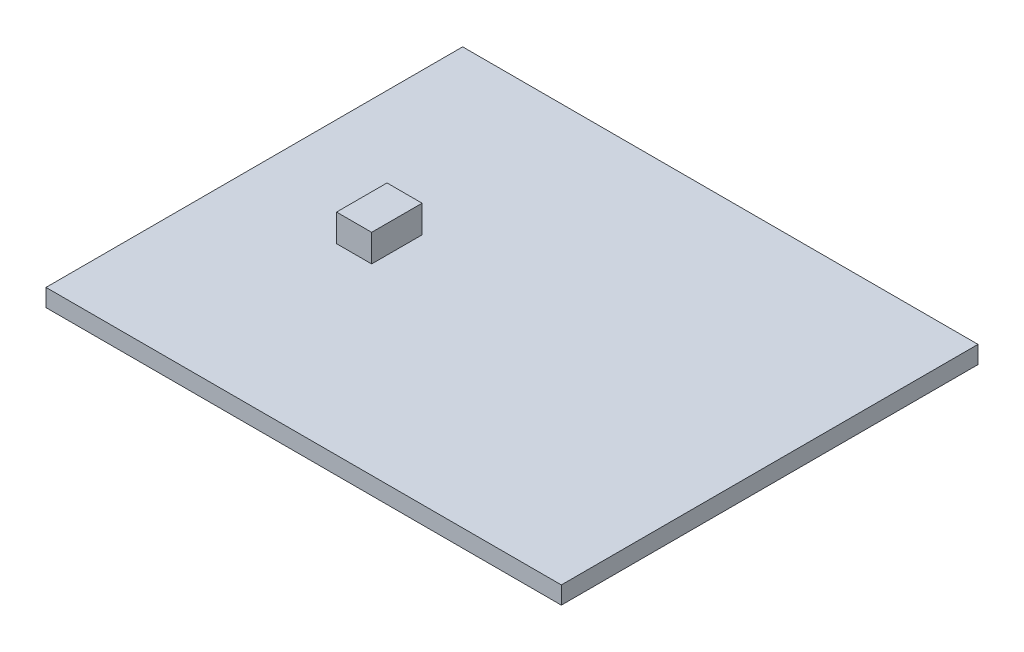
ISO-10303-21;
HEADER;
FILE_DESCRIPTION(('STEP AP214'),'2;1');
FILE_NAME('part.step','',(''),(''),'','','');
FILE_SCHEMA(('AUTOMOTIVE_DESIGN { 1 0 10303 214 1 1 1 1 }'));
ENDSEC;
DATA;
#1=APPLICATION_CONTEXT('core data for automotive mechanical design processes');
#2=APPLICATION_PROTOCOL_DEFINITION('international standard','automotive_design',2000,#1);
#3=PRODUCT_CONTEXT('',#1,'mechanical');
#4=PRODUCT('Part','Part','',(#3));
#5=PRODUCT_RELATED_PRODUCT_CATEGORY('part','',(#4));
#6=PRODUCT_DEFINITION_FORMATION('','',#4);
#7=PRODUCT_DEFINITION_CONTEXT('part definition',#1,'design');
#8=PRODUCT_DEFINITION('design','',#6,#7);
#9=PRODUCT_DEFINITION_SHAPE('','',#8);
#10=(LENGTH_UNIT() NAMED_UNIT(*) SI_UNIT(.MILLI.,.METRE.));
#11=(NAMED_UNIT(*) PLANE_ANGLE_UNIT() SI_UNIT($,.RADIAN.));
#12=(NAMED_UNIT(*) SI_UNIT($,.STERADIAN.) SOLID_ANGLE_UNIT());
#13=UNCERTAINTY_MEASURE_WITH_UNIT(LENGTH_MEASURE(1.E-05),#10,'distance_accuracy_value','');
#14=(GEOMETRIC_REPRESENTATION_CONTEXT(3) GLOBAL_UNCERTAINTY_ASSIGNED_CONTEXT((#13)) GLOBAL_UNIT_ASSIGNED_CONTEXT((#10,
#11,#12)) REPRESENTATION_CONTEXT('',''));
#15=CARTESIAN_POINT('',(0.,0.,0.));
#16=DIRECTION('',(0.,0.,1.));
#17=DIRECTION('',(1.,0.,0.));
#18=AXIS2_PLACEMENT_3D('',#15,#16,#17);
#19=CARTESIAN_POINT('',(0.,0.,0.));
#20=DIRECTION('',(0.,-1.,0.));
#21=DIRECTION('',(0.,0.,-1.));
#22=AXIS2_PLACEMENT_3D('',#19,#20,#21);
#23=PLANE('',#22);
#24=DIRECTION('',(0.,0.,1.));
#25=VECTOR('',#24,1.);
#26=CARTESIAN_POINT('',(0.,0.,0.));
#27=LINE('',#26,#25);
#28=CARTESIAN_POINT('',(0.,0.,-38.));
#29=VERTEX_POINT('',#28);
#30=CARTESIAN_POINT('',(0.,0.,0.));
#31=VERTEX_POINT('',#30);
#32=EDGE_CURVE('E183',#29,#31,#27,.T.);
#33=ORIENTED_EDGE('',*,*,#32,.F.);
#34=DIRECTION('',(-1.,0.,0.));
#35=VECTOR('',#34,1.);
#36=CARTESIAN_POINT('',(0.,0.,-38.));
#37=LINE('',#36,#35);
#38=CARTESIAN_POINT('',(47.,0.,-38.));
#39=VERTEX_POINT('',#38);
#40=EDGE_CURVE('E188',#39,#29,#37,.T.);
#41=ORIENTED_EDGE('',*,*,#40,.F.);
#42=DIRECTION('',(0.,0.,-1.));
#43=VECTOR('',#42,1.);
#44=CARTESIAN_POINT('',(47.,0.,0.));
#45=LINE('',#44,#43);
#46=CARTESIAN_POINT('',(47.,0.,0.));
#47=VERTEX_POINT('',#46);
#48=EDGE_CURVE('E199',#47,#39,#45,.T.);
#49=ORIENTED_EDGE('',*,*,#48,.F.);
#50=DIRECTION('',(1.,0.,0.));
#51=VECTOR('',#50,1.);
#52=CARTESIAN_POINT('',(0.,0.,0.));
#53=LINE('',#52,#51);
#54=EDGE_CURVE('E197',#31,#47,#53,.T.);
#55=ORIENTED_EDGE('',*,*,#54,.F.);
#56=EDGE_LOOP('',(#33,#41,#49,#55));
#57=FACE_BOUND('',#56,.T.);
#58=DIRECTION('',(1.,0.,0.));
#59=VECTOR('',#58,1.);
#60=CARTESIAN_POINT('',(13.0000000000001,0.,-21.3));
#61=LINE('',#60,#59);
#62=CARTESIAN_POINT('',(9.80000000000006,0.,-21.3));
#63=VERTEX_POINT('',#62);
#64=CARTESIAN_POINT('',(13.0000000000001,0.,-21.3));
#65=VERTEX_POINT('',#64);
#66=EDGE_CURVE('E373',#63,#65,#61,.T.);
#67=ORIENTED_EDGE('',*,*,#66,.F.);
#68=DIRECTION('',(0.,0.,-1.));
#69=VECTOR('',#68,1.);
#70=CARTESIAN_POINT('',(9.80000000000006,0.,-21.3));
#71=LINE('',#70,#69);
#72=CARTESIAN_POINT('',(9.80000000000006,0.,-16.7));
#73=VERTEX_POINT('',#72);
#74=EDGE_CURVE('E147',#73,#63,#71,.T.);
#75=ORIENTED_EDGE('',*,*,#74,.F.);
#76=DIRECTION('',(-1.,0.,0.));
#77=VECTOR('',#76,1.);
#78=CARTESIAN_POINT('',(9.80000000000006,0.,-16.7));
#79=LINE('',#78,#77);
#80=CARTESIAN_POINT('',(13.0000000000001,0.,-16.7));
#81=VERTEX_POINT('',#80);
#82=EDGE_CURVE('E143',#81,#73,#79,.T.);
#83=ORIENTED_EDGE('',*,*,#82,.F.);
#84=DIRECTION('',(0.,0.,1.));
#85=VECTOR('',#84,1.);
#86=CARTESIAN_POINT('',(13.0000000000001,0.,-16.7));
#87=LINE('',#86,#85);
#88=EDGE_CURVE('E370',#65,#81,#87,.T.);
#89=ORIENTED_EDGE('',*,*,#88,.F.);
#90=EDGE_LOOP('',(#67,#75,#83,#89));
#91=FACE_BOUND('',#90,.T.);
#92=ADVANCED_FACE('F35',(#57,#91),#23,.T.);
#93=CARTESIAN_POINT('',(0.,1.6,0.));
#94=DIRECTION('',(0.,-1.,0.));
#95=DIRECTION('',(0.,0.,-1.));
#96=AXIS2_PLACEMENT_3D('',#93,#94,#95);
#97=PLANE('',#96);
#98=DIRECTION('',(0.,0.,1.));
#99=VECTOR('',#98,1.);
#100=CARTESIAN_POINT('',(0.,1.6,0.));
#101=LINE('',#100,#99);
#102=CARTESIAN_POINT('',(0.,1.6,-38.));
#103=VERTEX_POINT('',#102);
#104=CARTESIAN_POINT('',(0.,1.6,0.));
#105=VERTEX_POINT('',#104);
#106=EDGE_CURVE('E184',#103,#105,#101,.T.);
#107=ORIENTED_EDGE('',*,*,#106,.T.);
#108=DIRECTION('',(1.,0.,0.));
#109=VECTOR('',#108,1.);
#110=CARTESIAN_POINT('',(0.,1.6,0.));
#111=LINE('',#110,#109);
#112=CARTESIAN_POINT('',(47.,1.6,0.));
#113=VERTEX_POINT('',#112);
#114=EDGE_CURVE('E187',#105,#113,#111,.T.);
#115=ORIENTED_EDGE('',*,*,#114,.T.);
#116=DIRECTION('',(0.,0.,-1.));
#117=VECTOR('',#116,1.);
#118=CARTESIAN_POINT('',(47.,1.6,0.));
#119=LINE('',#118,#117);
#120=CARTESIAN_POINT('',(47.,1.6,-38.));
#121=VERTEX_POINT('',#120);
#122=EDGE_CURVE('E190',#113,#121,#119,.T.);
#123=ORIENTED_EDGE('',*,*,#122,.T.);
#124=DIRECTION('',(-1.,0.,0.));
#125=VECTOR('',#124,1.);
#126=CARTESIAN_POINT('',(0.,1.6,-38.));
#127=LINE('',#126,#125);
#128=EDGE_CURVE('E192',#121,#103,#127,.T.);
#129=ORIENTED_EDGE('',*,*,#128,.T.);
#130=EDGE_LOOP('',(#107,#115,#123,#129));
#131=FACE_BOUND('',#130,.T.);
#132=DIRECTION('',(0.,0.,1.));
#133=VECTOR('',#132,1.);
#134=CARTESIAN_POINT('',(9.80000000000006,1.6,-21.3));
#135=LINE('',#134,#133);
#136=CARTESIAN_POINT('',(9.80000000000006,1.6,-21.3));
#137=VERTEX_POINT('',#136);
#138=CARTESIAN_POINT('',(9.80000000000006,1.6,-16.7));
#139=VERTEX_POINT('',#138);
#140=EDGE_CURVE('E149',#137,#139,#135,.T.);
#141=ORIENTED_EDGE('',*,*,#140,.F.);
#142=DIRECTION('',(-1.,0.,0.));
#143=VECTOR('',#142,1.);
#144=CARTESIAN_POINT('',(9.80000000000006,1.6,-21.3));
#145=LINE('',#144,#143);
#146=CARTESIAN_POINT('',(13.0000000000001,1.6,-21.3));
#147=VERTEX_POINT('',#146);
#148=EDGE_CURVE('E160',#147,#137,#145,.T.);
#149=ORIENTED_EDGE('',*,*,#148,.F.);
#150=DIRECTION('',(0.,0.,-1.));
#151=VECTOR('',#150,1.);
#152=CARTESIAN_POINT('',(13.0000000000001,1.6,-21.3));
#153=LINE('',#152,#151);
#154=CARTESIAN_POINT('',(13.0000000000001,1.6,-16.7));
#155=VERTEX_POINT('',#154);
#156=EDGE_CURVE('E168',#155,#147,#153,.T.);
#157=ORIENTED_EDGE('',*,*,#156,.F.);
#158=DIRECTION('',(1.,0.,0.));
#159=VECTOR('',#158,1.);
#160=CARTESIAN_POINT('',(9.80000000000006,1.6,-16.7));
#161=LINE('',#160,#159);
#162=EDGE_CURVE('E58',#139,#155,#161,.T.);
#163=ORIENTED_EDGE('',*,*,#162,.F.);
#164=EDGE_LOOP('',(#141,#149,#157,#163));
#165=FACE_BOUND('',#164,.T.);
#166=ADVANCED_FACE('F226',(#131,#165),#97,.F.);
#167=CARTESIAN_POINT('',(0.,1.6,0.));
#168=DIRECTION('',(1.,0.,0.));
#169=DIRECTION('',(0.,0.,-1.));
#170=AXIS2_PLACEMENT_3D('',#167,#168,#169);
#171=PLANE('',#170);
#172=ORIENTED_EDGE('',*,*,#32,.T.);
#173=DIRECTION('',(0.,-1.,0.));
#174=VECTOR('',#173,1.);
#175=CARTESIAN_POINT('',(0.,1.6,0.));
#176=LINE('',#175,#174);
#177=EDGE_CURVE('E11',#105,#31,#176,.T.);
#178=ORIENTED_EDGE('',*,*,#177,.F.);
#179=ORIENTED_EDGE('',*,*,#106,.F.);
#180=DIRECTION('',(0.,-1.,0.));
#181=VECTOR('',#180,1.);
#182=CARTESIAN_POINT('',(0.,1.6,-38.));
#183=LINE('',#182,#181);
#184=EDGE_CURVE('E194',#103,#29,#183,.T.);
#185=ORIENTED_EDGE('',*,*,#184,.T.);
#186=EDGE_LOOP('',(#172,#178,#179,#185));
#187=FACE_BOUND('',#186,.T.);
#188=ADVANCED_FACE('F37',(#187),#171,.F.);
#189=CARTESIAN_POINT('',(0.,1.6,0.));
#190=DIRECTION('',(0.,0.,-1.));
#191=DIRECTION('',(-1.,0.,0.));
#192=AXIS2_PLACEMENT_3D('',#189,#190,#191);
#193=PLANE('',#192);
#194=ORIENTED_EDGE('',*,*,#54,.T.);
#195=DIRECTION('',(0.,-1.,0.));
#196=VECTOR('',#195,1.);
#197=CARTESIAN_POINT('',(47.,1.6,0.));
#198=LINE('',#197,#196);
#199=EDGE_CURVE('E43',#113,#47,#198,.T.);
#200=ORIENTED_EDGE('',*,*,#199,.F.);
#201=ORIENTED_EDGE('',*,*,#114,.F.);
#202=ORIENTED_EDGE('',*,*,#177,.T.);
#203=EDGE_LOOP('',(#194,#200,#201,#202));
#204=FACE_BOUND('',#203,.T.);
#205=ADVANCED_FACE('F227',(#204),#193,.F.);
#206=CARTESIAN_POINT('',(47.,1.6,0.));
#207=DIRECTION('',(-1.,0.,0.));
#208=DIRECTION('',(0.,0.,1.));
#209=AXIS2_PLACEMENT_3D('',#206,#207,#208);
#210=PLANE('',#209);
#211=ORIENTED_EDGE('',*,*,#48,.T.);
#212=DIRECTION('',(0.,-1.,0.));
#213=VECTOR('',#212,1.);
#214=CARTESIAN_POINT('',(47.,1.6,-38.));
#215=LINE('',#214,#213);
#216=EDGE_CURVE('E204',#121,#39,#215,.T.);
#217=ORIENTED_EDGE('',*,*,#216,.F.);
#218=ORIENTED_EDGE('',*,*,#122,.F.);
#219=ORIENTED_EDGE('',*,*,#199,.T.);
#220=EDGE_LOOP('',(#211,#217,#218,#219));
#221=FACE_BOUND('',#220,.T.);
#222=ADVANCED_FACE('F211',(#221),#210,.F.);
#223=CARTESIAN_POINT('',(0.,1.6,-38.));
#224=DIRECTION('',(0.,0.,1.));
#225=DIRECTION('',(1.,0.,0.));
#226=AXIS2_PLACEMENT_3D('',#223,#224,#225);
#227=PLANE('',#226);
#228=ORIENTED_EDGE('',*,*,#40,.T.);
#229=ORIENTED_EDGE('',*,*,#184,.F.);
#230=ORIENTED_EDGE('',*,*,#128,.F.);
#231=ORIENTED_EDGE('',*,*,#216,.T.);
#232=EDGE_LOOP('',(#228,#229,#230,#231));
#233=FACE_BOUND('',#232,.T.);
#234=ADVANCED_FACE('F220',(#233),#227,.F.);
#235=CARTESIAN_POINT('',(9.80000000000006,4.1,-21.3));
#236=DIRECTION('',(1.,0.,0.));
#237=DIRECTION('',(0.,0.,-1.));
#238=AXIS2_PLACEMENT_3D('',#235,#236,#237);
#239=PLANE('',#238);
#240=ORIENTED_EDGE('',*,*,#140,.T.);
#241=DIRECTION('',(0.,-1.,0.));
#242=VECTOR('',#241,1.);
#243=CARTESIAN_POINT('',(9.80000000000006,4.1,-16.7));
#244=LINE('',#243,#242);
#245=CARTESIAN_POINT('',(9.80000000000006,4.1,-16.7));
#246=VERTEX_POINT('',#245);
#247=EDGE_CURVE('E181',#246,#139,#244,.T.);
#248=ORIENTED_EDGE('',*,*,#247,.F.);
#249=DIRECTION('',(0.,0.,1.));
#250=VECTOR('',#249,1.);
#251=CARTESIAN_POINT('',(9.80000000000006,4.1,-21.3));
#252=LINE('',#251,#250);
#253=CARTESIAN_POINT('',(9.80000000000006,4.1,-21.3));
#254=VERTEX_POINT('',#253);
#255=EDGE_CURVE('E156',#254,#246,#252,.T.);
#256=ORIENTED_EDGE('',*,*,#255,.F.);
#257=DIRECTION('',(0.,-1.,0.));
#258=VECTOR('',#257,1.);
#259=CARTESIAN_POINT('',(9.80000000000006,4.1,-21.3));
#260=LINE('',#259,#258);
#261=EDGE_CURVE('E165',#254,#137,#260,.T.);
#262=ORIENTED_EDGE('',*,*,#261,.T.);
#263=EDGE_LOOP('',(#240,#248,#256,#262));
#264=FACE_BOUND('',#263,.T.);
#265=ADVANCED_FACE('F245',(#264),#239,.F.);
#266=CARTESIAN_POINT('',(9.80000000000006,4.1,-16.7));
#267=DIRECTION('',(0.,0.,-1.));
#268=DIRECTION('',(-1.,0.,0.));
#269=AXIS2_PLACEMENT_3D('',#266,#267,#268);
#270=PLANE('',#269);
#271=ORIENTED_EDGE('',*,*,#162,.T.);
#272=DIRECTION('',(0.,-1.,0.));
#273=VECTOR('',#272,1.);
#274=CARTESIAN_POINT('',(13.0000000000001,4.1,-16.7));
#275=LINE('',#274,#273);
#276=CARTESIAN_POINT('',(13.0000000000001,4.1,-16.7));
#277=VERTEX_POINT('',#276);
#278=EDGE_CURVE('E178',#277,#155,#275,.T.);
#279=ORIENTED_EDGE('',*,*,#278,.F.);
#280=DIRECTION('',(1.,0.,0.));
#281=VECTOR('',#280,1.);
#282=CARTESIAN_POINT('',(9.80000000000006,4.1,-16.7));
#283=LINE('',#282,#281);
#284=EDGE_CURVE('E159',#246,#277,#283,.T.);
#285=ORIENTED_EDGE('',*,*,#284,.F.);
#286=ORIENTED_EDGE('',*,*,#247,.T.);
#287=EDGE_LOOP('',(#271,#279,#285,#286));
#288=FACE_BOUND('',#287,.T.);
#289=ADVANCED_FACE('F250',(#288),#270,.F.);
#290=CARTESIAN_POINT('',(13.0000000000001,4.1,-21.3));
#291=DIRECTION('',(-1.,0.,0.));
#292=DIRECTION('',(0.,0.,1.));
#293=AXIS2_PLACEMENT_3D('',#290,#291,#292);
#294=PLANE('',#293);
#295=ORIENTED_EDGE('',*,*,#156,.T.);
#296=DIRECTION('',(0.,-1.,0.));
#297=VECTOR('',#296,1.);
#298=CARTESIAN_POINT('',(13.0000000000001,4.1,-21.3));
#299=LINE('',#298,#297);
#300=CARTESIAN_POINT('',(13.0000000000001,4.1,-21.3));
#301=VERTEX_POINT('',#300);
#302=EDGE_CURVE('E175',#301,#147,#299,.T.);
#303=ORIENTED_EDGE('',*,*,#302,.F.);
#304=DIRECTION('',(0.,0.,-1.));
#305=VECTOR('',#304,1.);
#306=CARTESIAN_POINT('',(13.0000000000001,4.1,-21.3));
#307=LINE('',#306,#305);
#308=EDGE_CURVE('E162',#277,#301,#307,.T.);
#309=ORIENTED_EDGE('',*,*,#308,.F.);
#310=ORIENTED_EDGE('',*,*,#278,.T.);
#311=EDGE_LOOP('',(#295,#303,#309,#310));
#312=FACE_BOUND('',#311,.T.);
#313=ADVANCED_FACE('F256',(#312),#294,.F.);
#314=CARTESIAN_POINT('',(9.80000000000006,4.1,-21.3));
#315=DIRECTION('',(0.,0.,1.));
#316=DIRECTION('',(1.,0.,0.));
#317=AXIS2_PLACEMENT_3D('',#314,#315,#316);
#318=PLANE('',#317);
#319=ORIENTED_EDGE('',*,*,#148,.T.);
#320=ORIENTED_EDGE('',*,*,#261,.F.);
#321=DIRECTION('',(-1.,0.,0.));
#322=VECTOR('',#321,1.);
#323=CARTESIAN_POINT('',(9.80000000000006,4.1,-21.3));
#324=LINE('',#323,#322);
#325=EDGE_CURVE('E164',#301,#254,#324,.T.);
#326=ORIENTED_EDGE('',*,*,#325,.F.);
#327=ORIENTED_EDGE('',*,*,#302,.T.);
#328=EDGE_LOOP('',(#319,#320,#326,#327));
#329=FACE_BOUND('',#328,.T.);
#330=ADVANCED_FACE('F262',(#329),#318,.F.);
#331=CARTESIAN_POINT('',(0.,4.1,0.));
#332=DIRECTION('',(0.,1.,0.));
#333=DIRECTION('',(0.,0.,1.));
#334=AXIS2_PLACEMENT_3D('',#331,#332,#333);
#335=PLANE('',#334);
#336=ORIENTED_EDGE('',*,*,#255,.T.);
#337=ORIENTED_EDGE('',*,*,#284,.T.);
#338=ORIENTED_EDGE('',*,*,#308,.T.);
#339=ORIENTED_EDGE('',*,*,#325,.T.);
#340=EDGE_LOOP('',(#336,#337,#338,#339));
#341=FACE_BOUND('',#340,.T.);
#342=ADVANCED_FACE('F266',(#341),#335,.T.);
#343=CARTESIAN_POINT('',(9.80000000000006,-2.5,-21.3));
#344=DIRECTION('',(1.,0.,0.));
#345=DIRECTION('',(0.,0.,-1.));
#346=AXIS2_PLACEMENT_3D('',#343,#344,#345);
#347=PLANE('',#346);
#348=ORIENTED_EDGE('',*,*,#74,.T.);
#349=DIRECTION('',(0.,1.,0.));
#350=VECTOR('',#349,1.);
#351=CARTESIAN_POINT('',(9.80000000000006,-2.5,-21.3));
#352=LINE('',#351,#350);
#353=CARTESIAN_POINT('',(9.80000000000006,-2.5,-21.3));
#354=VERTEX_POINT('',#353);
#355=EDGE_CURVE('E128',#354,#63,#352,.T.);
#356=ORIENTED_EDGE('',*,*,#355,.F.);
#357=DIRECTION('',(0.,0.,-1.));
#358=VECTOR('',#357,1.);
#359=CARTESIAN_POINT('',(9.80000000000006,-2.5,-21.3));
#360=LINE('',#359,#358);
#361=CARTESIAN_POINT('',(9.80000000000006,-2.5,-16.7));
#362=VERTEX_POINT('',#361);
#363=EDGE_CURVE('E135',#362,#354,#360,.T.);
#364=ORIENTED_EDGE('',*,*,#363,.F.);
#365=DIRECTION('',(0.,1.,0.));
#366=VECTOR('',#365,1.);
#367=CARTESIAN_POINT('',(9.80000000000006,-2.5,-16.7));
#368=LINE('',#367,#366);
#369=EDGE_CURVE('E368',#362,#73,#368,.T.);
#370=ORIENTED_EDGE('',*,*,#369,.T.);
#371=EDGE_LOOP('',(#348,#356,#364,#370));
#372=FACE_BOUND('',#371,.T.);
#373=ADVANCED_FACE('F145',(#372),#347,.F.);
#374=CARTESIAN_POINT('',(13.0000000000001,-2.5,-21.3));
#375=DIRECTION('',(0.,0.,1.));
#376=DIRECTION('',(1.,0.,0.));
#377=AXIS2_PLACEMENT_3D('',#374,#375,#376);
#378=PLANE('',#377);
#379=ORIENTED_EDGE('',*,*,#66,.T.);
#380=DIRECTION('',(0.,1.,0.));
#381=VECTOR('',#380,1.);
#382=CARTESIAN_POINT('',(13.0000000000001,-2.5,-21.3));
#383=LINE('',#382,#381);
#384=CARTESIAN_POINT('',(13.0000000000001,-2.5,-21.3));
#385=VERTEX_POINT('',#384);
#386=EDGE_CURVE('E131',#385,#65,#383,.T.);
#387=ORIENTED_EDGE('',*,*,#386,.F.);
#388=DIRECTION('',(1.,0.,0.));
#389=VECTOR('',#388,1.);
#390=CARTESIAN_POINT('',(13.0000000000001,-2.5,-21.3));
#391=LINE('',#390,#389);
#392=EDGE_CURVE('E124',#354,#385,#391,.T.);
#393=ORIENTED_EDGE('',*,*,#392,.F.);
#394=ORIENTED_EDGE('',*,*,#355,.T.);
#395=EDGE_LOOP('',(#379,#387,#393,#394));
#396=FACE_BOUND('',#395,.T.);
#397=ADVANCED_FACE('F126',(#396),#378,.F.);
#398=CARTESIAN_POINT('',(13.0000000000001,-2.5,-16.7));
#399=DIRECTION('',(-1.,0.,0.));
#400=DIRECTION('',(0.,0.,1.));
#401=AXIS2_PLACEMENT_3D('',#398,#399,#400);
#402=PLANE('',#401);
#403=ORIENTED_EDGE('',*,*,#88,.T.);
#404=DIRECTION('',(0.,1.,0.));
#405=VECTOR('',#404,1.);
#406=CARTESIAN_POINT('',(13.0000000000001,-2.5,-16.7));
#407=LINE('',#406,#405);
#408=CARTESIAN_POINT('',(13.0000000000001,-2.5,-16.7));
#409=VERTEX_POINT('',#408);
#410=EDGE_CURVE('E50',#409,#81,#407,.T.);
#411=ORIENTED_EDGE('',*,*,#410,.F.);
#412=DIRECTION('',(0.,0.,1.));
#413=VECTOR('',#412,1.);
#414=CARTESIAN_POINT('',(13.0000000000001,-2.5,-16.7));
#415=LINE('',#414,#413);
#416=EDGE_CURVE('E134',#385,#409,#415,.T.);
#417=ORIENTED_EDGE('',*,*,#416,.F.);
#418=ORIENTED_EDGE('',*,*,#386,.T.);
#419=EDGE_LOOP('',(#403,#411,#417,#418));
#420=FACE_BOUND('',#419,.T.);
#421=ADVANCED_FACE('F275',(#420),#402,.F.);
#422=CARTESIAN_POINT('',(9.80000000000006,-2.5,-16.7));
#423=DIRECTION('',(0.,0.,-1.));
#424=DIRECTION('',(-1.,0.,0.));
#425=AXIS2_PLACEMENT_3D('',#422,#423,#424);
#426=PLANE('',#425);
#427=ORIENTED_EDGE('',*,*,#82,.T.);
#428=ORIENTED_EDGE('',*,*,#369,.F.);
#429=DIRECTION('',(-1.,0.,0.));
#430=VECTOR('',#429,1.);
#431=CARTESIAN_POINT('',(9.80000000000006,-2.5,-16.7));
#432=LINE('',#431,#430);
#433=EDGE_CURVE('E139',#409,#362,#432,.T.);
#434=ORIENTED_EDGE('',*,*,#433,.F.);
#435=ORIENTED_EDGE('',*,*,#410,.T.);
#436=EDGE_LOOP('',(#427,#428,#434,#435));
#437=FACE_BOUND('',#436,.T.);
#438=ADVANCED_FACE('F278',(#437),#426,.F.);
#439=CARTESIAN_POINT('',(0.,-2.5,0.));
#440=DIRECTION('',(0.,1.,0.));
#441=DIRECTION('',(0.,0.,1.));
#442=AXIS2_PLACEMENT_3D('',#439,#440,#441);
#443=PLANE('',#442);
#444=ORIENTED_EDGE('',*,*,#363,.T.);
#445=ORIENTED_EDGE('',*,*,#392,.T.);
#446=ORIENTED_EDGE('',*,*,#416,.T.);
#447=ORIENTED_EDGE('',*,*,#433,.T.);
#448=EDGE_LOOP('',(#444,#445,#446,#447));
#449=FACE_BOUND('',#448,.T.);
#450=ADVANCED_FACE('F138',(#449),#443,.F.);
#451=CLOSED_SHELL('',(#92,#166,#188,#205,#222,#234,#265,#289,#313,#330,#342,#373,#397,#421,#438,#450));
#452=MANIFOLD_SOLID_BREP('B2',#451);
#453=ADVANCED_BREP_SHAPE_REPRESENTATION('',(#18,#452),#14);
#454=SHAPE_DEFINITION_REPRESENTATION(#9,#453);
ENDSEC;
END-ISO-10303-21;
